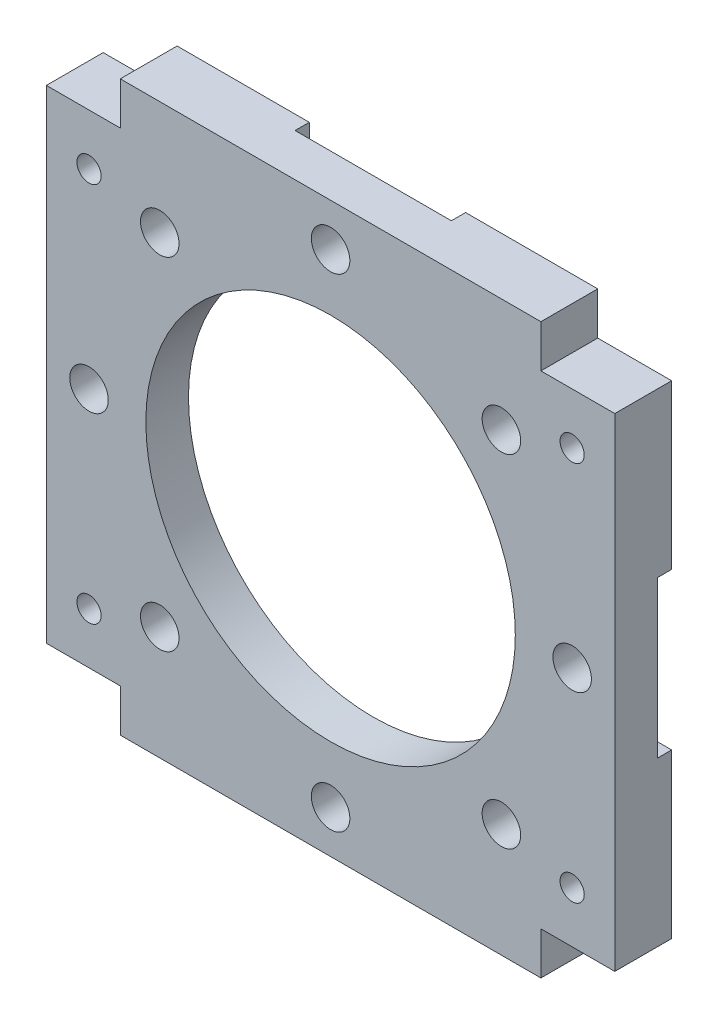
from build123d import *

# Parameters (mm, degrees)
EXTRUDE1_DEPTH               = 4.7625
EXTRUDE1_DEPTH_BACK          = 1.5875
SKETCH1_W                    = 63.5
SKETCH1_H                    = 53.975
SKETCH5_W                    = 46.99
SKETCH5_H                    = 4.7625
EXTRUDE2_DEPTH               = 6.35
SKETCH2_R                    = 30.2133
SKETCH2_R_2                  = 20.6375
CUT_EXTRUDE1_DEPTH           = 1.5875
SKETCH3_R                    = 20.6375
CUT_EXTRUDE2_DEPTH           = 46.348070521
CUT_EXTRUDE3_DEPTH           = 3.175
F_6_32_TAPPED_HOLE1_D        = 2.7051
F_18_0_1695_DIAMETER_HOLE1_D = 4.3053


with BuildPart() as part:
    # Sketch1 → Extrude1 (new, two sides: drawn at the far end of the back side and taken through both)
    with BuildSketch(Plane.XY.offset(-EXTRUDE1_DEPTH_BACK)):
        Rectangle(SKETCH1_W, SKETCH1_H)
    extrude(amount=EXTRUDE1_DEPTH + EXTRUDE1_DEPTH_BACK)

    # Sketch5 → Extrude2 (add)
    with BuildSketch(Plane.XY.offset(4.7625)):
        with Locations((0, 29.36875)):
            Rectangle(SKETCH5_W, SKETCH5_H)
        with Locations((0, -29.36875)):
            Rectangle(SKETCH5_W, SKETCH5_H)
    extrude(amount=-EXTRUDE2_DEPTH)

    # Sketch2 → Cut-Extrude1 (cut)
    with BuildSketch(Plane(origin=(0, 0, -1.5875), x_dir=(-1, 0, 0), z_dir=(0, 0, -1))):
        Circle(SKETCH2_R)
        Circle(SKETCH2_R_2, mode=Mode.SUBTRACT)
    extrude(amount=-CUT_EXTRUDE1_DEPTH, mode=Mode.SUBTRACT)

    # Sketch3 → Cut-Extrude2 (cut, through all)
    with BuildSketch(Plane(origin=(0, 0, -1.5875), x_dir=(-1, 0, 0), z_dir=(0, 0, -1))):
        Circle(SKETCH3_R)
    extrude(amount=-CUT_EXTRUDE2_DEPTH, mode=Mode.SUBTRACT)

    # Sketch6 → Cut-Extrude3 (cut)
    with BuildSketch(Plane(origin=(0, 0, 0), x_dir=(-1, 0, 0), z_dir=(0, 0, -1))):
        Polygon((8.73125, -8.73125), (8.73125, -38.1), (-8.73125, -38.1), (-8.73125, -8.73125), (-38.1, -8.73125), (-38.1, 8.73125), (-8.73125, 8.73125), (-8.73125, 38.1), (8.73125, 38.1), (8.73125, 8.73125), (38.1, 8.73125), (38.1, -8.73125), align=None)
    extrude(amount=CUT_EXTRUDE3_DEPTH, mode=Mode.SUBTRACT)

    # 6-32 Tapped Hole1 (through all)
    with Locations(Plane.XY.offset(4.7625)):
        with Locations((26.9875, -21.26875), (-26.9875, -21.26875), (-26.9875, 21.26875), (26.9875, 21.26875)):
            Hole(F_6_32_TAPPED_HOLE1_D / 2)

    # 18 _0.1695_ Diameter Hole1 (through all)
    with Locations(Plane(origin=(0, 0, 0), x_dir=(-1, 0, 0), z_dir=(0, 0, -1))):
        with Locations((0, 26.9875), (19.083044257, 19.083044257), (26.9875, 0), (19.083044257, -19.083044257), (0, -26.9875), (-19.083044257, -19.083044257), (-26.9875, 0), (-19.083044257, 19.083044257)):
            Hole(F_18_0_1695_DIAMETER_HOLE1_D / 2)


solid = part.part
